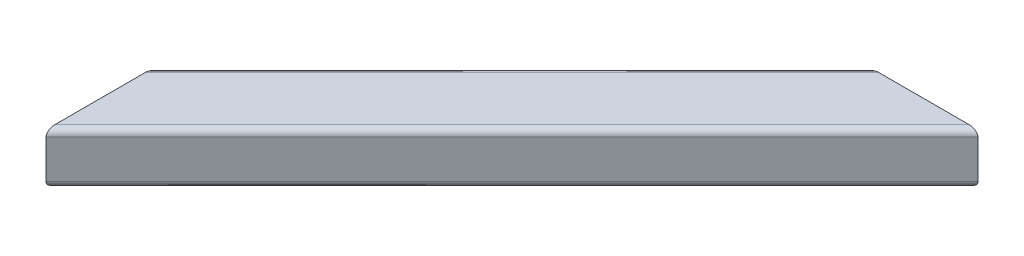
from build123d import *

# Parameters (mm, degrees)
TUBE_RECTANGULAR_120_X_80_X_5_0_1_DEPTH = 2326.861919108


with BuildPart() as part:
    # Sketch11 → Tube _rectangular_ 120 X 80 X 5.0_1 (new body)
    with BuildSketch(Plane(origin=(874.155013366, 0, -1237.743780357), x_dir=(0, 1, 0), z_dir=(-0.7071067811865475, 0, 0.7071067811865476))):
        with BuildLine():
            Line((-30, -60), (30, -60))
            ThreePointArc((30, -60), (37.071067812, -57.071067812), (40, -50))
            Line((40, -50), (40, 50))
            ThreePointArc((40, 50), (37.071067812, 57.071067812), (30, 60))
            Line((30, 60), (-30, 60))
            ThreePointArc((-30, 60), (-37.071067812, 57.071067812), (-40, 50))
            Line((-40, 50), (-40, -50))
            ThreePointArc((-40, -50), (-37.071067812, -57.071067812), (-30, -60))
        make_face()
        with BuildLine():
            Line((-30, -55), (30, -55))
            ThreePointArc((30, -55), (33.535533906, -53.535533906), (35, -50))
            Line((35, -50), (35, 50))
            ThreePointArc((35, 50), (33.535533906, 53.535533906), (30, 55))
            Line((30, 55), (-30, 55))
            ThreePointArc((-30, 55), (-33.535533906, 53.535533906), (-35, 50))
            Line((-35, 50), (-35, -50))
            ThreePointArc((-35, -50), (-33.535533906, -53.535533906), (-30, -55))
        make_face(mode=Mode.SUBTRACT)
    extrude(amount=TUBE_RECTANGULAR_120_X_80_X_5_0_1_DEPTH)

    # Przytnij_Wyd_u_1
    split(bisect_by=Plane(origin=(0, 0, -1016.41695165), x_dir=(0, -1, 0), z_dir=(0, 0, 1)), keep=Keep.TOP)

    # Przytnij_Wyd_u_1 4
    split(bisect_by=Plane.YZ.offset(8.894201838), keep=Keep.TOP)


solid = part.part
